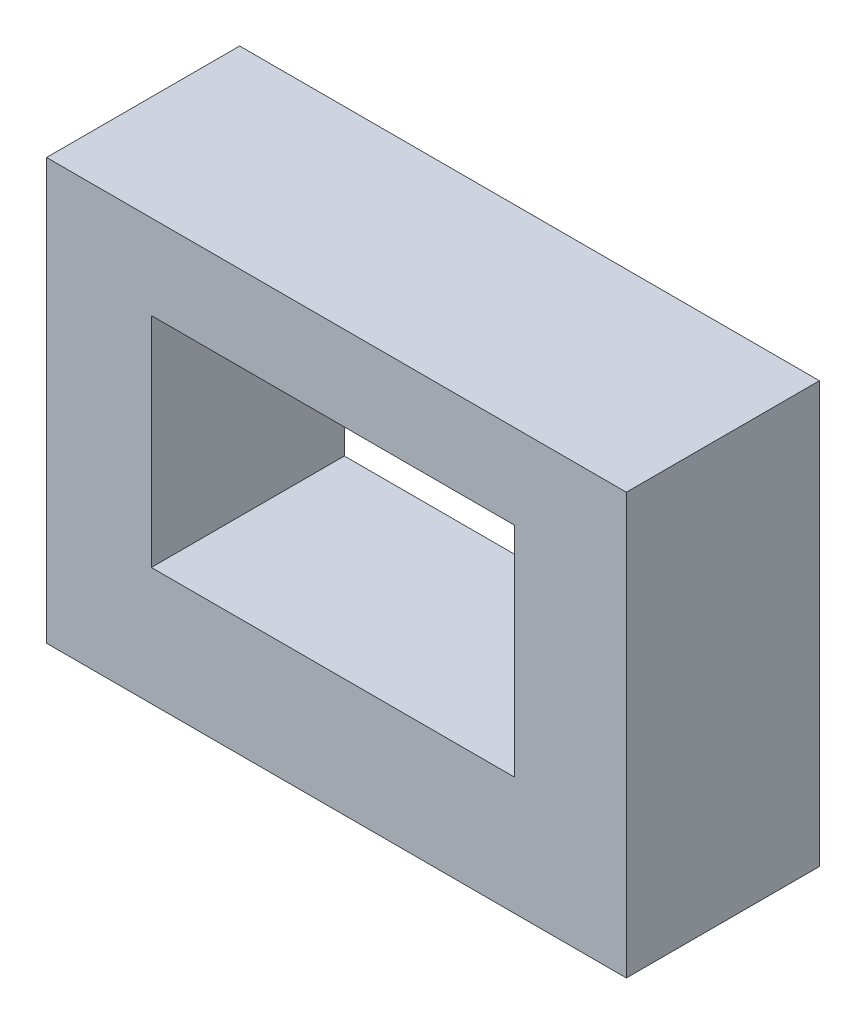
ISO-10303-21;
HEADER;
FILE_DESCRIPTION(('STEP AP214'),'2;1');
FILE_NAME('part.step','',(''),(''),'','','');
FILE_SCHEMA(('AUTOMOTIVE_DESIGN { 1 0 10303 214 1 1 1 1 }'));
ENDSEC;
DATA;
#1=APPLICATION_CONTEXT('core data for automotive mechanical design processes');
#2=APPLICATION_PROTOCOL_DEFINITION('international standard','automotive_design',2000,#1);
#3=PRODUCT_CONTEXT('',#1,'mechanical');
#4=PRODUCT('Part','Part','',(#3));
#5=PRODUCT_RELATED_PRODUCT_CATEGORY('part','',(#4));
#6=PRODUCT_DEFINITION_FORMATION('','',#4);
#7=PRODUCT_DEFINITION_CONTEXT('part definition',#1,'design');
#8=PRODUCT_DEFINITION('design','',#6,#7);
#9=PRODUCT_DEFINITION_SHAPE('','',#8);
#10=(LENGTH_UNIT() NAMED_UNIT(*) SI_UNIT(.MILLI.,.METRE.));
#11=(NAMED_UNIT(*) PLANE_ANGLE_UNIT() SI_UNIT($,.RADIAN.));
#12=(NAMED_UNIT(*) SI_UNIT($,.STERADIAN.) SOLID_ANGLE_UNIT());
#13=UNCERTAINTY_MEASURE_WITH_UNIT(LENGTH_MEASURE(1.E-05),#10,'distance_accuracy_value','');
#14=(GEOMETRIC_REPRESENTATION_CONTEXT(3) GLOBAL_UNCERTAINTY_ASSIGNED_CONTEXT((#13)) GLOBAL_UNIT_ASSIGNED_CONTEXT((#10,
#11,#12)) REPRESENTATION_CONTEXT('',''));
#15=CARTESIAN_POINT('',(0.,0.,0.));
#16=DIRECTION('',(0.,0.,1.));
#17=DIRECTION('',(1.,0.,0.));
#18=AXIS2_PLACEMENT_3D('',#15,#16,#17);
#19=CARTESIAN_POINT('',(0.,0.,16.51));
#20=DIRECTION('',(1.,0.,0.));
#21=DIRECTION('',(0.,0.,-1.));
#22=AXIS2_PLACEMENT_3D('',#19,#20,#21);
#23=PLANE('',#22);
#24=DIRECTION('',(0.,-1.,0.));
#25=VECTOR('',#24,1.);
#26=CARTESIAN_POINT('',(0.,0.,0.));
#27=LINE('',#26,#25);
#28=CARTESIAN_POINT('',(0.,35.9779903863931,0.));
#29=VERTEX_POINT('',#28);
#30=CARTESIAN_POINT('',(0.,0.,0.));
#31=VERTEX_POINT('',#30);
#32=EDGE_CURVE('E130',#29,#31,#27,.T.);
#33=ORIENTED_EDGE('',*,*,#32,.T.);
#34=DIRECTION('',(0.,0.,-1.));
#35=VECTOR('',#34,1.);
#36=CARTESIAN_POINT('',(0.,0.,16.51));
#37=LINE('',#36,#35);
#38=CARTESIAN_POINT('',(0.,0.,16.51));
#39=VERTEX_POINT('',#38);
#40=EDGE_CURVE('E11',#39,#31,#37,.T.);
#41=ORIENTED_EDGE('',*,*,#40,.F.);
#42=DIRECTION('',(0.,-1.,0.));
#43=VECTOR('',#42,1.);
#44=CARTESIAN_POINT('',(0.,0.,16.51));
#45=LINE('',#44,#43);
#46=CARTESIAN_POINT('',(0.,35.9779903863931,16.51));
#47=VERTEX_POINT('',#46);
#48=EDGE_CURVE('E142',#47,#39,#45,.T.);
#49=ORIENTED_EDGE('',*,*,#48,.F.);
#50=DIRECTION('',(0.,0.,-1.));
#51=VECTOR('',#50,1.);
#52=CARTESIAN_POINT('',(0.,35.9779903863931,16.51));
#53=LINE('',#52,#51);
#54=EDGE_CURVE('E151',#47,#29,#53,.T.);
#55=ORIENTED_EDGE('',*,*,#54,.T.);
#56=EDGE_LOOP('',(#33,#41,#49,#55));
#57=FACE_BOUND('',#56,.T.);
#58=ADVANCED_FACE('F33',(#57),#23,.F.);
#59=CARTESIAN_POINT('',(0.,0.,16.51));
#60=DIRECTION('',(0.,1.,0.));
#61=DIRECTION('',(0.,0.,1.));
#62=AXIS2_PLACEMENT_3D('',#59,#60,#61);
#63=PLANE('',#62);
#64=DIRECTION('',(1.,0.,0.));
#65=VECTOR('',#64,1.);
#66=CARTESIAN_POINT('',(0.,0.,0.));
#67=LINE('',#66,#65);
#68=CARTESIAN_POINT('',(49.5809761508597,0.,0.));
#69=VERTEX_POINT('',#68);
#70=EDGE_CURVE('E136',#31,#69,#67,.T.);
#71=ORIENTED_EDGE('',*,*,#70,.T.);
#72=DIRECTION('',(0.,0.,-1.));
#73=VECTOR('',#72,1.);
#74=CARTESIAN_POINT('',(49.5809761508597,0.,16.51));
#75=LINE('',#74,#73);
#76=CARTESIAN_POINT('',(49.5809761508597,0.,16.51));
#77=VERTEX_POINT('',#76);
#78=EDGE_CURVE('E40',#77,#69,#75,.T.);
#79=ORIENTED_EDGE('',*,*,#78,.F.);
#80=DIRECTION('',(1.,0.,0.));
#81=VECTOR('',#80,1.);
#82=CARTESIAN_POINT('',(0.,0.,16.51));
#83=LINE('',#82,#81);
#84=EDGE_CURVE('E145',#39,#77,#83,.T.);
#85=ORIENTED_EDGE('',*,*,#84,.F.);
#86=ORIENTED_EDGE('',*,*,#40,.T.);
#87=EDGE_LOOP('',(#71,#79,#85,#86));
#88=FACE_BOUND('',#87,.T.);
#89=ADVANCED_FACE('F175',(#88),#63,.F.);
#90=CARTESIAN_POINT('',(49.5809761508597,0.,16.51));
#91=DIRECTION('',(-1.,0.,0.));
#92=DIRECTION('',(0.,0.,1.));
#93=AXIS2_PLACEMENT_3D('',#90,#91,#92);
#94=PLANE('',#93);
#95=DIRECTION('',(0.,1.,0.));
#96=VECTOR('',#95,1.);
#97=CARTESIAN_POINT('',(49.5809761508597,0.,0.));
#98=LINE('',#97,#96);
#99=CARTESIAN_POINT('',(49.5809761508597,35.9779903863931,0.));
#100=VERTEX_POINT('',#99);
#101=EDGE_CURVE('E138',#69,#100,#98,.T.);
#102=ORIENTED_EDGE('',*,*,#101,.T.);
#103=DIRECTION('',(0.,0.,-1.));
#104=VECTOR('',#103,1.);
#105=CARTESIAN_POINT('',(49.5809761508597,35.9779903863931,16.51));
#106=LINE('',#105,#104);
#107=CARTESIAN_POINT('',(49.5809761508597,35.9779903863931,16.51));
#108=VERTEX_POINT('',#107);
#109=EDGE_CURVE('E154',#108,#100,#106,.T.);
#110=ORIENTED_EDGE('',*,*,#109,.F.);
#111=DIRECTION('',(0.,1.,0.));
#112=VECTOR('',#111,1.);
#113=CARTESIAN_POINT('',(49.5809761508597,0.,16.51));
#114=LINE('',#113,#112);
#115=EDGE_CURVE('E147',#77,#108,#114,.T.);
#116=ORIENTED_EDGE('',*,*,#115,.F.);
#117=ORIENTED_EDGE('',*,*,#78,.T.);
#118=EDGE_LOOP('',(#102,#110,#116,#117));
#119=FACE_BOUND('',#118,.T.);
#120=ADVANCED_FACE('F161',(#119),#94,.F.);
#121=CARTESIAN_POINT('',(0.,35.9779903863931,16.51));
#122=DIRECTION('',(0.,-1.,0.));
#123=DIRECTION('',(0.,0.,-1.));
#124=AXIS2_PLACEMENT_3D('',#121,#122,#123);
#125=PLANE('',#124);
#126=DIRECTION('',(-1.,0.,0.));
#127=VECTOR('',#126,1.);
#128=CARTESIAN_POINT('',(0.,35.9779903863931,0.));
#129=LINE('',#128,#127);
#130=EDGE_CURVE('E140',#100,#29,#129,.T.);
#131=ORIENTED_EDGE('',*,*,#130,.T.);
#132=ORIENTED_EDGE('',*,*,#54,.F.);
#133=DIRECTION('',(-1.,0.,0.));
#134=VECTOR('',#133,1.);
#135=CARTESIAN_POINT('',(0.,35.9779903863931,16.51));
#136=LINE('',#135,#134);
#137=EDGE_CURVE('E149',#108,#47,#136,.T.);
#138=ORIENTED_EDGE('',*,*,#137,.F.);
#139=ORIENTED_EDGE('',*,*,#109,.T.);
#140=EDGE_LOOP('',(#131,#132,#138,#139));
#141=FACE_BOUND('',#140,.T.);
#142=ADVANCED_FACE('F168',(#141),#125,.F.);
#143=CARTESIAN_POINT('',(0.,35.9779903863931,16.51));
#144=DIRECTION('',(0.,0.,-1.));
#145=DIRECTION('',(-1.,0.,0.));
#146=AXIS2_PLACEMENT_3D('',#143,#144,#145);
#147=PLANE('',#146);
#148=DIRECTION('',(1.,0.,0.));
#149=VECTOR('',#148,1.);
#150=CARTESIAN_POINT('',(8.95724244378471,10.0930434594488,16.51));
#151=LINE('',#150,#149);
#152=CARTESIAN_POINT('',(8.95724244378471,10.0930434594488,16.51));
#153=VERTEX_POINT('',#152);
#154=CARTESIAN_POINT('',(40.0002502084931,10.0930434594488,16.51));
#155=VERTEX_POINT('',#154);
#156=EDGE_CURVE('E124',#153,#155,#151,.T.);
#157=ORIENTED_EDGE('',*,*,#156,.F.);
#158=DIRECTION('',(0.,-1.,0.));
#159=VECTOR('',#158,1.);
#160=CARTESIAN_POINT('',(8.95724244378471,28.7502397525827,16.51));
#161=LINE('',#160,#159);
#162=CARTESIAN_POINT('',(8.95724244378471,28.7502397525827,16.51));
#163=VERTEX_POINT('',#162);
#164=EDGE_CURVE('E47',#163,#153,#161,.T.);
#165=ORIENTED_EDGE('',*,*,#164,.F.);
#166=DIRECTION('',(-1.,0.,0.));
#167=VECTOR('',#166,1.);
#168=CARTESIAN_POINT('',(8.95724244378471,28.7502397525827,16.51));
#169=LINE('',#168,#167);
#170=CARTESIAN_POINT('',(40.0002502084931,28.7502397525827,16.51));
#171=VERTEX_POINT('',#170);
#172=EDGE_CURVE('E115',#171,#163,#169,.T.);
#173=ORIENTED_EDGE('',*,*,#172,.F.);
#174=DIRECTION('',(0.,1.,0.));
#175=VECTOR('',#174,1.);
#176=CARTESIAN_POINT('',(40.0002502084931,28.7502397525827,16.51));
#177=LINE('',#176,#175);
#178=EDGE_CURVE('E118',#155,#171,#177,.T.);
#179=ORIENTED_EDGE('',*,*,#178,.F.);
#180=EDGE_LOOP('',(#157,#165,#173,#179));
#181=FACE_BOUND('',#180,.T.);
#182=ORIENTED_EDGE('',*,*,#48,.T.);
#183=ORIENTED_EDGE('',*,*,#84,.T.);
#184=ORIENTED_EDGE('',*,*,#115,.T.);
#185=ORIENTED_EDGE('',*,*,#137,.T.);
#186=EDGE_LOOP('',(#182,#183,#184,#185));
#187=FACE_BOUND('',#186,.T.);
#188=ADVANCED_FACE('F174',(#181,#187),#147,.F.);
#189=CARTESIAN_POINT('',(0.,35.9779903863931,0.));
#190=DIRECTION('',(0.,0.,-1.));
#191=DIRECTION('',(-1.,0.,0.));
#192=AXIS2_PLACEMENT_3D('',#189,#190,#191);
#193=PLANE('',#192);
#194=DIRECTION('',(0.,-1.,0.));
#195=VECTOR('',#194,1.);
#196=CARTESIAN_POINT('',(8.95724244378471,28.7502397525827,0.));
#197=LINE('',#196,#195);
#198=CARTESIAN_POINT('',(8.95724244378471,28.7502397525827,0.));
#199=VERTEX_POINT('',#198);
#200=CARTESIAN_POINT('',(8.95724244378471,10.0930434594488,0.));
#201=VERTEX_POINT('',#200);
#202=EDGE_CURVE('E99',#199,#201,#197,.T.);
#203=ORIENTED_EDGE('',*,*,#202,.T.);
#204=DIRECTION('',(1.,0.,0.));
#205=VECTOR('',#204,1.);
#206=CARTESIAN_POINT('',(8.95724244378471,10.0930434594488,0.));
#207=LINE('',#206,#205);
#208=CARTESIAN_POINT('',(40.0002502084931,10.0930434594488,0.));
#209=VERTEX_POINT('',#208);
#210=EDGE_CURVE('E108',#201,#209,#207,.T.);
#211=ORIENTED_EDGE('',*,*,#210,.T.);
#212=DIRECTION('',(0.,1.,0.));
#213=VECTOR('',#212,1.);
#214=CARTESIAN_POINT('',(40.0002502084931,28.7502397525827,0.));
#215=LINE('',#214,#213);
#216=CARTESIAN_POINT('',(40.0002502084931,28.7502397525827,0.));
#217=VERTEX_POINT('',#216);
#218=EDGE_CURVE('E55',#209,#217,#215,.T.);
#219=ORIENTED_EDGE('',*,*,#218,.T.);
#220=DIRECTION('',(-1.,0.,0.));
#221=VECTOR('',#220,1.);
#222=CARTESIAN_POINT('',(8.95724244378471,28.7502397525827,0.));
#223=LINE('',#222,#221);
#224=EDGE_CURVE('E105',#217,#199,#223,.T.);
#225=ORIENTED_EDGE('',*,*,#224,.T.);
#226=EDGE_LOOP('',(#203,#211,#219,#225));
#227=FACE_BOUND('',#226,.T.);
#228=ORIENTED_EDGE('',*,*,#32,.F.);
#229=ORIENTED_EDGE('',*,*,#130,.F.);
#230=ORIENTED_EDGE('',*,*,#101,.F.);
#231=ORIENTED_EDGE('',*,*,#70,.F.);
#232=EDGE_LOOP('',(#228,#229,#230,#231));
#233=FACE_BOUND('',#232,.T.);
#234=ADVANCED_FACE('F112',(#227,#233),#193,.T.);
#235=CARTESIAN_POINT('',(8.95724244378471,28.7502397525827,0.));
#236=DIRECTION('',(-1.,0.,0.));
#237=DIRECTION('',(0.,0.,1.));
#238=AXIS2_PLACEMENT_3D('',#235,#236,#237);
#239=PLANE('',#238);
#240=ORIENTED_EDGE('',*,*,#164,.T.);
#241=DIRECTION('',(0.,0.,1.));
#242=VECTOR('',#241,1.);
#243=CARTESIAN_POINT('',(8.95724244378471,10.0930434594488,0.));
#244=LINE('',#243,#242);
#245=EDGE_CURVE('E95',#201,#153,#244,.T.);
#246=ORIENTED_EDGE('',*,*,#245,.F.);
#247=ORIENTED_EDGE('',*,*,#202,.F.);
#248=DIRECTION('',(0.,0.,1.));
#249=VECTOR('',#248,1.);
#250=CARTESIAN_POINT('',(8.95724244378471,28.7502397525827,0.));
#251=LINE('',#250,#249);
#252=EDGE_CURVE('E128',#199,#163,#251,.T.);
#253=ORIENTED_EDGE('',*,*,#252,.T.);
#254=EDGE_LOOP('',(#240,#246,#247,#253));
#255=FACE_BOUND('',#254,.T.);
#256=ADVANCED_FACE('F97',(#255),#239,.F.);
#257=CARTESIAN_POINT('',(8.95724244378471,28.7502397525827,0.));
#258=DIRECTION('',(0.,1.,0.));
#259=DIRECTION('',(0.,0.,1.));
#260=AXIS2_PLACEMENT_3D('',#257,#258,#259);
#261=PLANE('',#260);
#262=ORIENTED_EDGE('',*,*,#172,.T.);
#263=ORIENTED_EDGE('',*,*,#252,.F.);
#264=ORIENTED_EDGE('',*,*,#224,.F.);
#265=DIRECTION('',(0.,0.,1.));
#266=VECTOR('',#265,1.);
#267=CARTESIAN_POINT('',(40.0002502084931,28.7502397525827,0.));
#268=LINE('',#267,#266);
#269=EDGE_CURVE('E131',#217,#171,#268,.T.);
#270=ORIENTED_EDGE('',*,*,#269,.T.);
#271=EDGE_LOOP('',(#262,#263,#264,#270));
#272=FACE_BOUND('',#271,.T.);
#273=ADVANCED_FACE('F192',(#272),#261,.F.);
#274=CARTESIAN_POINT('',(40.0002502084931,28.7502397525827,0.));
#275=DIRECTION('',(1.,0.,0.));
#276=DIRECTION('',(0.,0.,-1.));
#277=AXIS2_PLACEMENT_3D('',#274,#275,#276);
#278=PLANE('',#277);
#279=ORIENTED_EDGE('',*,*,#178,.T.);
#280=ORIENTED_EDGE('',*,*,#269,.F.);
#281=ORIENTED_EDGE('',*,*,#218,.F.);
#282=DIRECTION('',(0.,0.,1.));
#283=VECTOR('',#282,1.);
#284=CARTESIAN_POINT('',(40.0002502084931,10.0930434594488,0.));
#285=LINE('',#284,#283);
#286=EDGE_CURVE('E104',#209,#155,#285,.T.);
#287=ORIENTED_EDGE('',*,*,#286,.T.);
#288=EDGE_LOOP('',(#279,#280,#281,#287));
#289=FACE_BOUND('',#288,.T.);
#290=ADVANCED_FACE('F195',(#289),#278,.F.);
#291=CARTESIAN_POINT('',(8.95724244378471,10.0930434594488,0.));
#292=DIRECTION('',(0.,-1.,0.));
#293=DIRECTION('',(0.,0.,-1.));
#294=AXIS2_PLACEMENT_3D('',#291,#292,#293);
#295=PLANE('',#294);
#296=ORIENTED_EDGE('',*,*,#156,.T.);
#297=ORIENTED_EDGE('',*,*,#286,.F.);
#298=ORIENTED_EDGE('',*,*,#210,.F.);
#299=ORIENTED_EDGE('',*,*,#245,.T.);
#300=EDGE_LOOP('',(#296,#297,#298,#299));
#301=FACE_BOUND('',#300,.T.);
#302=ADVANCED_FACE('F109',(#301),#295,.F.);
#303=CLOSED_SHELL('',(#58,#89,#120,#142,#188,#234,#256,#273,#290,#302));
#304=MANIFOLD_SOLID_BREP('B2',#303);
#305=ADVANCED_BREP_SHAPE_REPRESENTATION('',(#18,#304),#14);
#306=SHAPE_DEFINITION_REPRESENTATION(#9,#305);
ENDSEC;
END-ISO-10303-21;
